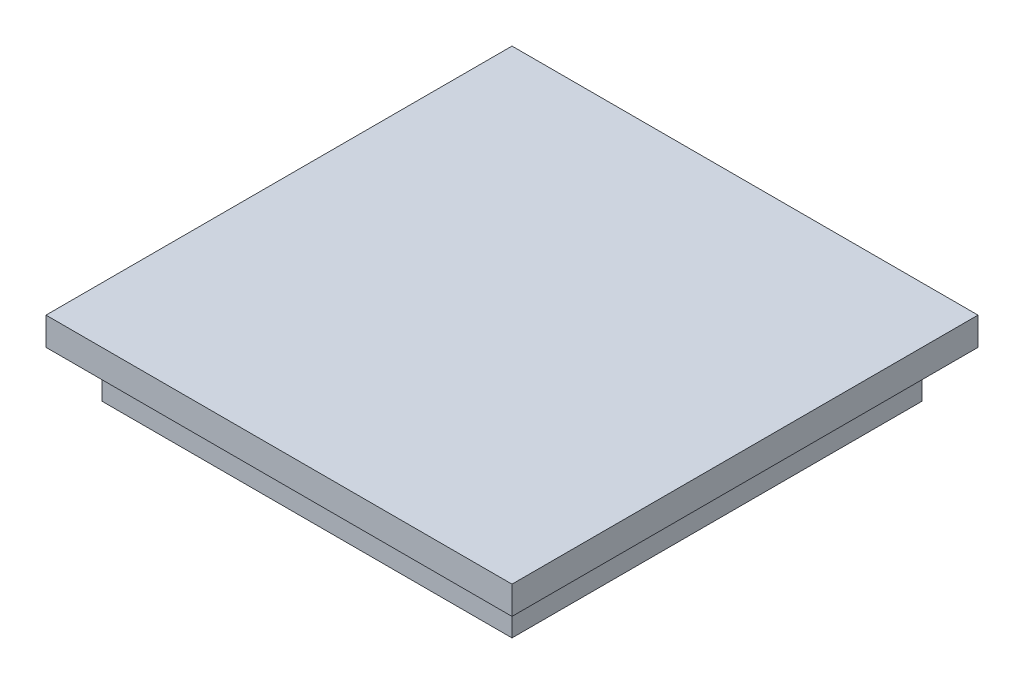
ISO-10303-21;
HEADER;
FILE_DESCRIPTION(('STEP AP214'),'2;1');
FILE_NAME('part.step','',(''),(''),'','','');
FILE_SCHEMA(('AUTOMOTIVE_DESIGN { 1 0 10303 214 1 1 1 1 }'));
ENDSEC;
DATA;
#1=APPLICATION_CONTEXT('core data for automotive mechanical design processes');
#2=APPLICATION_PROTOCOL_DEFINITION('international standard','automotive_design',2000,#1);
#3=PRODUCT_CONTEXT('',#1,'mechanical');
#4=PRODUCT('Part','Part','',(#3));
#5=PRODUCT_RELATED_PRODUCT_CATEGORY('part','',(#4));
#6=PRODUCT_DEFINITION_FORMATION('','',#4);
#7=PRODUCT_DEFINITION_CONTEXT('part definition',#1,'design');
#8=PRODUCT_DEFINITION('design','',#6,#7);
#9=PRODUCT_DEFINITION_SHAPE('','',#8);
#10=(LENGTH_UNIT() NAMED_UNIT(*) SI_UNIT(.MILLI.,.METRE.));
#11=(NAMED_UNIT(*) PLANE_ANGLE_UNIT() SI_UNIT($,.RADIAN.));
#12=(NAMED_UNIT(*) SI_UNIT($,.STERADIAN.) SOLID_ANGLE_UNIT());
#13=UNCERTAINTY_MEASURE_WITH_UNIT(LENGTH_MEASURE(1.E-05),#10,'distance_accuracy_value','');
#14=(GEOMETRIC_REPRESENTATION_CONTEXT(3) GLOBAL_UNCERTAINTY_ASSIGNED_CONTEXT((#13)) GLOBAL_UNIT_ASSIGNED_CONTEXT((#10,
#11,#12)) REPRESENTATION_CONTEXT('',''));
#15=CARTESIAN_POINT('',(0.,0.,0.));
#16=DIRECTION('',(0.,0.,1.));
#17=DIRECTION('',(1.,0.,0.));
#18=AXIS2_PLACEMENT_3D('',#15,#16,#17);
#19=CARTESIAN_POINT('',(50.,0.,0.));
#20=DIRECTION('',(0.,-1.,0.));
#21=DIRECTION('',(0.,0.,-1.));
#22=AXIS2_PLACEMENT_3D('',#19,#20,#21);
#23=PLANE('',#22);
#24=DIRECTION('',(0.,0.,-1.));
#25=VECTOR('',#24,1.);
#26=CARTESIAN_POINT('',(50.,0.,-50.));
#27=LINE('',#26,#25);
#28=CARTESIAN_POINT('',(50.,0.,0.));
#29=VERTEX_POINT('',#28);
#30=CARTESIAN_POINT('',(50.,0.,-50.));
#31=VERTEX_POINT('',#30);
#32=EDGE_CURVE('E188',#29,#31,#27,.T.);
#33=ORIENTED_EDGE('',*,*,#32,.F.);
#34=DIRECTION('',(1.,0.,0.));
#35=VECTOR('',#34,1.);
#36=CARTESIAN_POINT('',(50.,0.,0.));
#37=LINE('',#36,#35);
#38=CARTESIAN_POINT('',(0.,0.,0.));
#39=VERTEX_POINT('',#38);
#40=EDGE_CURVE('E193',#39,#29,#37,.T.);
#41=ORIENTED_EDGE('',*,*,#40,.F.);
#42=DIRECTION('',(0.,0.,1.));
#43=VECTOR('',#42,1.);
#44=CARTESIAN_POINT('',(0.,0.,-50.));
#45=LINE('',#44,#43);
#46=CARTESIAN_POINT('',(0.,0.,-50.));
#47=VERTEX_POINT('',#46);
#48=EDGE_CURVE('E204',#47,#39,#45,.T.);
#49=ORIENTED_EDGE('',*,*,#48,.F.);
#50=DIRECTION('',(-1.,0.,0.));
#51=VECTOR('',#50,1.);
#52=CARTESIAN_POINT('',(50.,0.,-50.));
#53=LINE('',#52,#51);
#54=EDGE_CURVE('E202',#31,#47,#53,.T.);
#55=ORIENTED_EDGE('',*,*,#54,.F.);
#56=EDGE_LOOP('',(#33,#41,#49,#55));
#57=FACE_BOUND('',#56,.T.);
#58=DIRECTION('',(1.,0.,0.));
#59=VECTOR('',#58,1.);
#60=CARTESIAN_POINT('',(3.,0.,-47.));
#61=LINE('',#60,#59);
#62=CARTESIAN_POINT('',(3.,0.,-47.));
#63=VERTEX_POINT('',#62);
#64=CARTESIAN_POINT('',(47.,0.,-47.));
#65=VERTEX_POINT('',#64);
#66=EDGE_CURVE('E175',#63,#65,#61,.T.);
#67=ORIENTED_EDGE('',*,*,#66,.F.);
#68=DIRECTION('',(0.,0.,-1.));
#69=VECTOR('',#68,1.);
#70=CARTESIAN_POINT('',(3.,0.,-3.));
#71=LINE('',#70,#69);
#72=CARTESIAN_POINT('',(3.,0.,-3.));
#73=VERTEX_POINT('',#72);
#74=EDGE_CURVE('E140',#73,#63,#71,.T.);
#75=ORIENTED_EDGE('',*,*,#74,.F.);
#76=DIRECTION('',(-1.,0.,0.));
#77=VECTOR('',#76,1.);
#78=CARTESIAN_POINT('',(3.,0.,-3.));
#79=LINE('',#78,#77);
#80=CARTESIAN_POINT('',(47.,0.,-3.));
#81=VERTEX_POINT('',#80);
#82=EDGE_CURVE('E166',#81,#73,#79,.T.);
#83=ORIENTED_EDGE('',*,*,#82,.F.);
#84=DIRECTION('',(0.,0.,1.));
#85=VECTOR('',#84,1.);
#86=CARTESIAN_POINT('',(47.,0.,-3.));
#87=LINE('',#86,#85);
#88=EDGE_CURVE('E177',#65,#81,#87,.T.);
#89=ORIENTED_EDGE('',*,*,#88,.F.);
#90=EDGE_LOOP('',(#67,#75,#83,#89));
#91=FACE_BOUND('',#90,.T.);
#92=ADVANCED_FACE('F32',(#57,#91),#23,.T.);
#93=CARTESIAN_POINT('',(50.,3.,-50.));
#94=DIRECTION('',(-1.,0.,0.));
#95=DIRECTION('',(0.,0.,1.));
#96=AXIS2_PLACEMENT_3D('',#93,#94,#95);
#97=PLANE('',#96);
#98=ORIENTED_EDGE('',*,*,#32,.T.);
#99=DIRECTION('',(0.,-1.,0.));
#100=VECTOR('',#99,1.);
#101=CARTESIAN_POINT('',(50.,3.,-50.));
#102=LINE('',#101,#100);
#103=CARTESIAN_POINT('',(50.,3.,-50.));
#104=VERTEX_POINT('',#103);
#105=EDGE_CURVE('E11',#104,#31,#102,.T.);
#106=ORIENTED_EDGE('',*,*,#105,.F.);
#107=DIRECTION('',(0.,0.,-1.));
#108=VECTOR('',#107,1.);
#109=CARTESIAN_POINT('',(50.,3.,-50.));
#110=LINE('',#109,#108);
#111=CARTESIAN_POINT('',(50.,3.,0.));
#112=VERTEX_POINT('',#111);
#113=EDGE_CURVE('E189',#112,#104,#110,.T.);
#114=ORIENTED_EDGE('',*,*,#113,.F.);
#115=DIRECTION('',(0.,-1.,0.));
#116=VECTOR('',#115,1.);
#117=CARTESIAN_POINT('',(50.,3.,0.));
#118=LINE('',#117,#116);
#119=EDGE_CURVE('E199',#112,#29,#118,.T.);
#120=ORIENTED_EDGE('',*,*,#119,.T.);
#121=EDGE_LOOP('',(#98,#106,#114,#120));
#122=FACE_BOUND('',#121,.T.);
#123=ADVANCED_FACE('F34',(#122),#97,.F.);
#124=CARTESIAN_POINT('',(50.,3.,-50.));
#125=DIRECTION('',(0.,0.,1.));
#126=DIRECTION('',(1.,0.,0.));
#127=AXIS2_PLACEMENT_3D('',#124,#125,#126);
#128=PLANE('',#127);
#129=ORIENTED_EDGE('',*,*,#54,.T.);
#130=DIRECTION('',(0.,-1.,0.));
#131=VECTOR('',#130,1.);
#132=CARTESIAN_POINT('',(0.,3.,-50.));
#133=LINE('',#132,#131);
#134=CARTESIAN_POINT('',(0.,3.,-50.));
#135=VERTEX_POINT('',#134);
#136=EDGE_CURVE('E40',#135,#47,#133,.T.);
#137=ORIENTED_EDGE('',*,*,#136,.F.);
#138=DIRECTION('',(-1.,0.,0.));
#139=VECTOR('',#138,1.);
#140=CARTESIAN_POINT('',(50.,3.,-50.));
#141=LINE('',#140,#139);
#142=EDGE_CURVE('E192',#104,#135,#141,.T.);
#143=ORIENTED_EDGE('',*,*,#142,.F.);
#144=ORIENTED_EDGE('',*,*,#105,.T.);
#145=EDGE_LOOP('',(#129,#137,#143,#144));
#146=FACE_BOUND('',#145,.T.);
#147=ADVANCED_FACE('F232',(#146),#128,.F.);
#148=CARTESIAN_POINT('',(0.,3.,-50.));
#149=DIRECTION('',(1.,0.,0.));
#150=DIRECTION('',(0.,0.,-1.));
#151=AXIS2_PLACEMENT_3D('',#148,#149,#150);
#152=PLANE('',#151);
#153=ORIENTED_EDGE('',*,*,#48,.T.);
#154=DIRECTION('',(0.,-1.,0.));
#155=VECTOR('',#154,1.);
#156=CARTESIAN_POINT('',(0.,3.,0.));
#157=LINE('',#156,#155);
#158=CARTESIAN_POINT('',(0.,3.,0.));
#159=VERTEX_POINT('',#158);
#160=EDGE_CURVE('E209',#159,#39,#157,.T.);
#161=ORIENTED_EDGE('',*,*,#160,.F.);
#162=DIRECTION('',(0.,0.,1.));
#163=VECTOR('',#162,1.);
#164=CARTESIAN_POINT('',(0.,3.,-50.));
#165=LINE('',#164,#163);
#166=EDGE_CURVE('E195',#135,#159,#165,.T.);
#167=ORIENTED_EDGE('',*,*,#166,.F.);
#168=ORIENTED_EDGE('',*,*,#136,.T.);
#169=EDGE_LOOP('',(#153,#161,#167,#168));
#170=FACE_BOUND('',#169,.T.);
#171=ADVANCED_FACE('F216',(#170),#152,.F.);
#172=CARTESIAN_POINT('',(50.,3.,0.));
#173=DIRECTION('',(0.,0.,-1.));
#174=DIRECTION('',(-1.,0.,0.));
#175=AXIS2_PLACEMENT_3D('',#172,#173,#174);
#176=PLANE('',#175);
#177=ORIENTED_EDGE('',*,*,#40,.T.);
#178=ORIENTED_EDGE('',*,*,#119,.F.);
#179=DIRECTION('',(1.,0.,0.));
#180=VECTOR('',#179,1.);
#181=CARTESIAN_POINT('',(50.,3.,0.));
#182=LINE('',#181,#180);
#183=EDGE_CURVE('E197',#159,#112,#182,.T.);
#184=ORIENTED_EDGE('',*,*,#183,.F.);
#185=ORIENTED_EDGE('',*,*,#160,.T.);
#186=EDGE_LOOP('',(#177,#178,#184,#185));
#187=FACE_BOUND('',#186,.T.);
#188=ADVANCED_FACE('F225',(#187),#176,.F.);
#189=CARTESIAN_POINT('',(50.,3.,0.));
#190=DIRECTION('',(0.,-1.,0.));
#191=DIRECTION('',(0.,0.,-1.));
#192=AXIS2_PLACEMENT_3D('',#189,#190,#191);
#193=PLANE('',#192);
#194=ORIENTED_EDGE('',*,*,#113,.T.);
#195=ORIENTED_EDGE('',*,*,#142,.T.);
#196=ORIENTED_EDGE('',*,*,#166,.T.);
#197=ORIENTED_EDGE('',*,*,#183,.T.);
#198=EDGE_LOOP('',(#194,#195,#196,#197));
#199=FACE_BOUND('',#198,.T.);
#200=ADVANCED_FACE('F231',(#199),#193,.F.);
#201=CARTESIAN_POINT('',(3.,-5.,-47.));
#202=DIRECTION('',(0.,-1.,0.));
#203=DIRECTION('',(0.,0.,-1.));
#204=AXIS2_PLACEMENT_3D('',#201,#202,#203);
#205=PLANE('',#204);
#206=DIRECTION('',(0.,0.,-1.));
#207=VECTOR('',#206,1.);
#208=CARTESIAN_POINT('',(3.,-5.,-3.));
#209=LINE('',#208,#207);
#210=CARTESIAN_POINT('',(3.,-5.,-3.));
#211=VERTEX_POINT('',#210);
#212=CARTESIAN_POINT('',(3.,-5.,-47.));
#213=VERTEX_POINT('',#212);
#214=EDGE_CURVE('E162',#211,#213,#209,.T.);
#215=ORIENTED_EDGE('',*,*,#214,.T.);
#216=DIRECTION('',(1.,0.,0.));
#217=VECTOR('',#216,1.);
#218=CARTESIAN_POINT('',(3.,-5.,-47.));
#219=LINE('',#218,#217);
#220=CARTESIAN_POINT('',(47.,-5.,-47.));
#221=VERTEX_POINT('',#220);
#222=EDGE_CURVE('E165',#213,#221,#219,.T.);
#223=ORIENTED_EDGE('',*,*,#222,.T.);
#224=DIRECTION('',(0.,0.,1.));
#225=VECTOR('',#224,1.);
#226=CARTESIAN_POINT('',(47.,-5.,-3.));
#227=LINE('',#226,#225);
#228=CARTESIAN_POINT('',(47.,-5.,-3.));
#229=VERTEX_POINT('',#228);
#230=EDGE_CURVE('E168',#221,#229,#227,.T.);
#231=ORIENTED_EDGE('',*,*,#230,.T.);
#232=DIRECTION('',(-1.,0.,0.));
#233=VECTOR('',#232,1.);
#234=CARTESIAN_POINT('',(3.,-5.,-3.));
#235=LINE('',#234,#233);
#236=EDGE_CURVE('E170',#229,#211,#235,.T.);
#237=ORIENTED_EDGE('',*,*,#236,.T.);
#238=EDGE_LOOP('',(#215,#223,#231,#237));
#239=FACE_BOUND('',#238,.T.);
#240=DIRECTION('',(1.,0.,0.));
#241=VECTOR('',#240,1.);
#242=CARTESIAN_POINT('',(5.,-5.,-45.));
#243=LINE('',#242,#241);
#244=CARTESIAN_POINT('',(5.,-5.,-45.));
#245=VERTEX_POINT('',#244);
#246=CARTESIAN_POINT('',(45.,-5.,-45.));
#247=VERTEX_POINT('',#246);
#248=EDGE_CURVE('E132',#245,#247,#243,.T.);
#249=ORIENTED_EDGE('',*,*,#248,.F.);
#250=DIRECTION('',(0.,0.,-1.));
#251=VECTOR('',#250,1.);
#252=CARTESIAN_POINT('',(5.,-5.,-5.));
#253=LINE('',#252,#251);
#254=CARTESIAN_POINT('',(5.,-5.,-5.));
#255=VERTEX_POINT('',#254);
#256=EDGE_CURVE('E123',#255,#245,#253,.T.);
#257=ORIENTED_EDGE('',*,*,#256,.F.);
#258=DIRECTION('',(-1.,0.,0.));
#259=VECTOR('',#258,1.);
#260=CARTESIAN_POINT('',(5.,-5.,-5.));
#261=LINE('',#260,#259);
#262=CARTESIAN_POINT('',(45.,-5.,-5.));
#263=VERTEX_POINT('',#262);
#264=EDGE_CURVE('E148',#263,#255,#261,.T.);
#265=ORIENTED_EDGE('',*,*,#264,.F.);
#266=DIRECTION('',(0.,0.,1.));
#267=VECTOR('',#266,1.);
#268=CARTESIAN_POINT('',(45.,-5.,-5.));
#269=LINE('',#268,#267);
#270=EDGE_CURVE('E146',#247,#263,#269,.T.);
#271=ORIENTED_EDGE('',*,*,#270,.F.);
#272=EDGE_LOOP('',(#249,#257,#265,#271));
#273=FACE_BOUND('',#272,.T.);
#274=ADVANCED_FACE('F144',(#239,#273),#205,.T.);
#275=CARTESIAN_POINT('',(3.,-5.,-3.));
#276=DIRECTION('',(1.,0.,0.));
#277=DIRECTION('',(0.,0.,-1.));
#278=AXIS2_PLACEMENT_3D('',#275,#276,#277);
#279=PLANE('',#278);
#280=ORIENTED_EDGE('',*,*,#74,.T.);
#281=DIRECTION('',(0.,1.,0.));
#282=VECTOR('',#281,1.);
#283=CARTESIAN_POINT('',(3.,-5.,-47.));
#284=LINE('',#283,#282);
#285=EDGE_CURVE('E186',#213,#63,#284,.T.);
#286=ORIENTED_EDGE('',*,*,#285,.F.);
#287=ORIENTED_EDGE('',*,*,#214,.F.);
#288=DIRECTION('',(0.,1.,0.));
#289=VECTOR('',#288,1.);
#290=CARTESIAN_POINT('',(3.,-5.,-3.));
#291=LINE('',#290,#289);
#292=EDGE_CURVE('E172',#211,#73,#291,.T.);
#293=ORIENTED_EDGE('',*,*,#292,.T.);
#294=EDGE_LOOP('',(#280,#286,#287,#293));
#295=FACE_BOUND('',#294,.T.);
#296=ADVANCED_FACE('F268',(#295),#279,.F.);
#297=CARTESIAN_POINT('',(3.,-5.,-47.));
#298=DIRECTION('',(0.,0.,1.));
#299=DIRECTION('',(1.,0.,0.));
#300=AXIS2_PLACEMENT_3D('',#297,#298,#299);
#301=PLANE('',#300);
#302=ORIENTED_EDGE('',*,*,#66,.T.);
#303=DIRECTION('',(0.,1.,0.));
#304=VECTOR('',#303,1.);
#305=CARTESIAN_POINT('',(47.,-5.,-47.));
#306=LINE('',#305,#304);
#307=EDGE_CURVE('E183',#221,#65,#306,.T.);
#308=ORIENTED_EDGE('',*,*,#307,.F.);
#309=ORIENTED_EDGE('',*,*,#222,.F.);
#310=ORIENTED_EDGE('',*,*,#285,.T.);
#311=EDGE_LOOP('',(#302,#308,#309,#310));
#312=FACE_BOUND('',#311,.T.);
#313=ADVANCED_FACE('F275',(#312),#301,.F.);
#314=CARTESIAN_POINT('',(47.,-5.,-3.));
#315=DIRECTION('',(-1.,0.,0.));
#316=DIRECTION('',(0.,0.,1.));
#317=AXIS2_PLACEMENT_3D('',#314,#315,#316);
#318=PLANE('',#317);
#319=ORIENTED_EDGE('',*,*,#88,.T.);
#320=DIRECTION('',(0.,1.,0.));
#321=VECTOR('',#320,1.);
#322=CARTESIAN_POINT('',(47.,-5.,-3.));
#323=LINE('',#322,#321);
#324=EDGE_CURVE('E47',#229,#81,#323,.T.);
#325=ORIENTED_EDGE('',*,*,#324,.F.);
#326=ORIENTED_EDGE('',*,*,#230,.F.);
#327=ORIENTED_EDGE('',*,*,#307,.T.);
#328=EDGE_LOOP('',(#319,#325,#326,#327));
#329=FACE_BOUND('',#328,.T.);
#330=ADVANCED_FACE('F272',(#329),#318,.F.);
#331=CARTESIAN_POINT('',(3.,-5.,-3.));
#332=DIRECTION('',(0.,0.,-1.));
#333=DIRECTION('',(-1.,0.,0.));
#334=AXIS2_PLACEMENT_3D('',#331,#332,#333);
#335=PLANE('',#334);
#336=ORIENTED_EDGE('',*,*,#82,.T.);
#337=ORIENTED_EDGE('',*,*,#292,.F.);
#338=ORIENTED_EDGE('',*,*,#236,.F.);
#339=ORIENTED_EDGE('',*,*,#324,.T.);
#340=EDGE_LOOP('',(#336,#337,#338,#339));
#341=FACE_BOUND('',#340,.T.);
#342=ADVANCED_FACE('F265',(#341),#335,.F.);
#343=CARTESIAN_POINT('',(5.,-5.,-5.));
#344=DIRECTION('',(1.,0.,0.));
#345=DIRECTION('',(0.,0.,-1.));
#346=AXIS2_PLACEMENT_3D('',#343,#344,#345);
#347=PLANE('',#346);
#348=DIRECTION('',(0.,0.,-1.));
#349=VECTOR('',#348,1.);
#350=CARTESIAN_POINT('',(5.,0.,-5.));
#351=LINE('',#350,#349);
#352=CARTESIAN_POINT('',(5.,0.,-5.));
#353=VERTEX_POINT('',#352);
#354=CARTESIAN_POINT('',(5.,0.,-45.));
#355=VERTEX_POINT('',#354);
#356=EDGE_CURVE('E55',#353,#355,#351,.T.);
#357=ORIENTED_EDGE('',*,*,#356,.F.);
#358=DIRECTION('',(0.,1.,0.));
#359=VECTOR('',#358,1.);
#360=CARTESIAN_POINT('',(5.,-5.,-5.));
#361=LINE('',#360,#359);
#362=EDGE_CURVE('E128',#255,#353,#361,.T.);
#363=ORIENTED_EDGE('',*,*,#362,.F.);
#364=ORIENTED_EDGE('',*,*,#256,.T.);
#365=DIRECTION('',(0.,1.,0.));
#366=VECTOR('',#365,1.);
#367=CARTESIAN_POINT('',(5.,-5.,-45.));
#368=LINE('',#367,#366);
#369=EDGE_CURVE('E126',#245,#355,#368,.T.);
#370=ORIENTED_EDGE('',*,*,#369,.T.);
#371=EDGE_LOOP('',(#357,#363,#364,#370));
#372=FACE_BOUND('',#371,.T.);
#373=ADVANCED_FACE('F125',(#372),#347,.T.);
#374=CARTESIAN_POINT('',(5.,-5.,-45.));
#375=DIRECTION('',(0.,0.,1.));
#376=DIRECTION('',(1.,0.,0.));
#377=AXIS2_PLACEMENT_3D('',#374,#375,#376);
#378=PLANE('',#377);
#379=DIRECTION('',(1.,0.,0.));
#380=VECTOR('',#379,1.);
#381=CARTESIAN_POINT('',(5.,0.,-45.));
#382=LINE('',#381,#380);
#383=CARTESIAN_POINT('',(45.,0.,-45.));
#384=VERTEX_POINT('',#383);
#385=EDGE_CURVE('E139',#355,#384,#382,.T.);
#386=ORIENTED_EDGE('',*,*,#385,.F.);
#387=ORIENTED_EDGE('',*,*,#369,.F.);
#388=ORIENTED_EDGE('',*,*,#248,.T.);
#389=DIRECTION('',(0.,1.,0.));
#390=VECTOR('',#389,1.);
#391=CARTESIAN_POINT('',(45.,-5.,-45.));
#392=LINE('',#391,#390);
#393=EDGE_CURVE('E141',#247,#384,#392,.T.);
#394=ORIENTED_EDGE('',*,*,#393,.T.);
#395=EDGE_LOOP('',(#386,#387,#388,#394));
#396=FACE_BOUND('',#395,.T.);
#397=ADVANCED_FACE('F136',(#396),#378,.T.);
#398=CARTESIAN_POINT('',(45.,-5.,-5.));
#399=DIRECTION('',(-1.,0.,0.));
#400=DIRECTION('',(0.,0.,1.));
#401=AXIS2_PLACEMENT_3D('',#398,#399,#400);
#402=PLANE('',#401);
#403=DIRECTION('',(0.,0.,1.));
#404=VECTOR('',#403,1.);
#405=CARTESIAN_POINT('',(45.,0.,-5.));
#406=LINE('',#405,#404);
#407=CARTESIAN_POINT('',(45.,0.,-5.));
#408=VERTEX_POINT('',#407);
#409=EDGE_CURVE('E154',#384,#408,#406,.T.);
#410=ORIENTED_EDGE('',*,*,#409,.F.);
#411=ORIENTED_EDGE('',*,*,#393,.F.);
#412=ORIENTED_EDGE('',*,*,#270,.T.);
#413=DIRECTION('',(0.,1.,0.));
#414=VECTOR('',#413,1.);
#415=CARTESIAN_POINT('',(45.,-5.,-5.));
#416=LINE('',#415,#414);
#417=EDGE_CURVE('E158',#263,#408,#416,.T.);
#418=ORIENTED_EDGE('',*,*,#417,.T.);
#419=EDGE_LOOP('',(#410,#411,#412,#418));
#420=FACE_BOUND('',#419,.T.);
#421=ADVANCED_FACE('F251',(#420),#402,.T.);
#422=CARTESIAN_POINT('',(5.,-5.,-5.));
#423=DIRECTION('',(0.,0.,-1.));
#424=DIRECTION('',(-1.,0.,0.));
#425=AXIS2_PLACEMENT_3D('',#422,#423,#424);
#426=PLANE('',#425);
#427=DIRECTION('',(-1.,0.,0.));
#428=VECTOR('',#427,1.);
#429=CARTESIAN_POINT('',(5.,0.,-5.));
#430=LINE('',#429,#428);
#431=EDGE_CURVE('E133',#408,#353,#430,.T.);
#432=ORIENTED_EDGE('',*,*,#431,.F.);
#433=ORIENTED_EDGE('',*,*,#417,.F.);
#434=ORIENTED_EDGE('',*,*,#264,.T.);
#435=ORIENTED_EDGE('',*,*,#362,.T.);
#436=EDGE_LOOP('',(#432,#433,#434,#435));
#437=FACE_BOUND('',#436,.T.);
#438=ADVANCED_FACE('F247',(#437),#426,.T.);
#439=ORIENTED_EDGE('',*,*,#356,.T.);
#440=ORIENTED_EDGE('',*,*,#385,.T.);
#441=ORIENTED_EDGE('',*,*,#409,.T.);
#442=ORIENTED_EDGE('',*,*,#431,.T.);
#443=EDGE_LOOP('',(#439,#440,#441,#442));
#444=FACE_BOUND('',#443,.T.);
#445=ADVANCED_FACE('F241',(#444),#23,.T.);
#446=CLOSED_SHELL('',(#92,#123,#147,#171,#188,#200,#274,#296,#313,#330,#342,#373,#397,#421,#438,#445));
#447=MANIFOLD_SOLID_BREP('B2',#446);
#448=ADVANCED_BREP_SHAPE_REPRESENTATION('',(#18,#447),#14);
#449=SHAPE_DEFINITION_REPRESENTATION(#9,#448);
ENDSEC;
END-ISO-10303-21;
